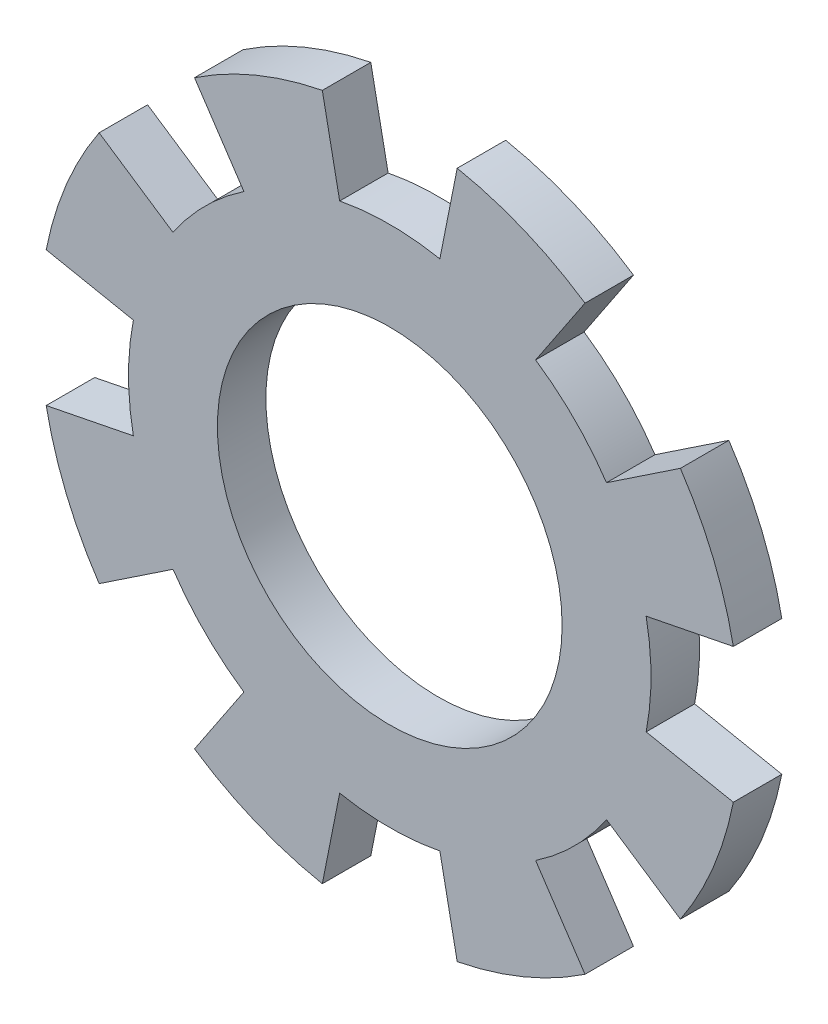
from build123d import *

# Parameters (mm, degrees)
BODYSKE_W      = 1.65
BODYSKE_H      = 0.45
TOOTHCUT_DEPTH = 5.618170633
TOOTHPAT_COUNT = 8


with BuildPart() as part:
    # BodySke → BaseBody (revolve)
    with BuildSketch(Plane(origin=(0, 0, 0), x_dir=(1, 0, 0), z_dir=(0, 1, 0))):
        with Locations((2.425, 0.225)):
            Rectangle(BODYSKE_W, BODYSKE_H)
    revolve(axis=Axis((0, 0, 0), (0, 0, -1)))

    # ToothSke → ToothCut (cut, through all)
    with BuildSketch(Plane.XY):
        with BuildLine():
            Line((-0.465079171, 2.37998453), (-0.638136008, 3.25))
            Line((-0.638136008, 3.25), (0.638136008, 3.25))
            Line((0.638136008, 3.25), (0.465079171, 2.37998453))
            ThreePointArc((0.465079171, 2.37998453), (0, 2.425), (-0.465079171, 2.37998453))
        make_face()
    toothcut = extrude(amount=-TOOTHCUT_DEPTH, mode=Mode.SUBTRACT)

    # ToothPat: ToothCut ×8 about axis
    toothpat_axis = Axis((0, 0, 0), (0, 0, 1))
    for i in range(1, TOOTHPAT_COUNT):
        add(toothcut.rotate(toothpat_axis, i * 360 / TOOTHPAT_COUNT), mode=Mode.SUBTRACT)


solid = part.part
